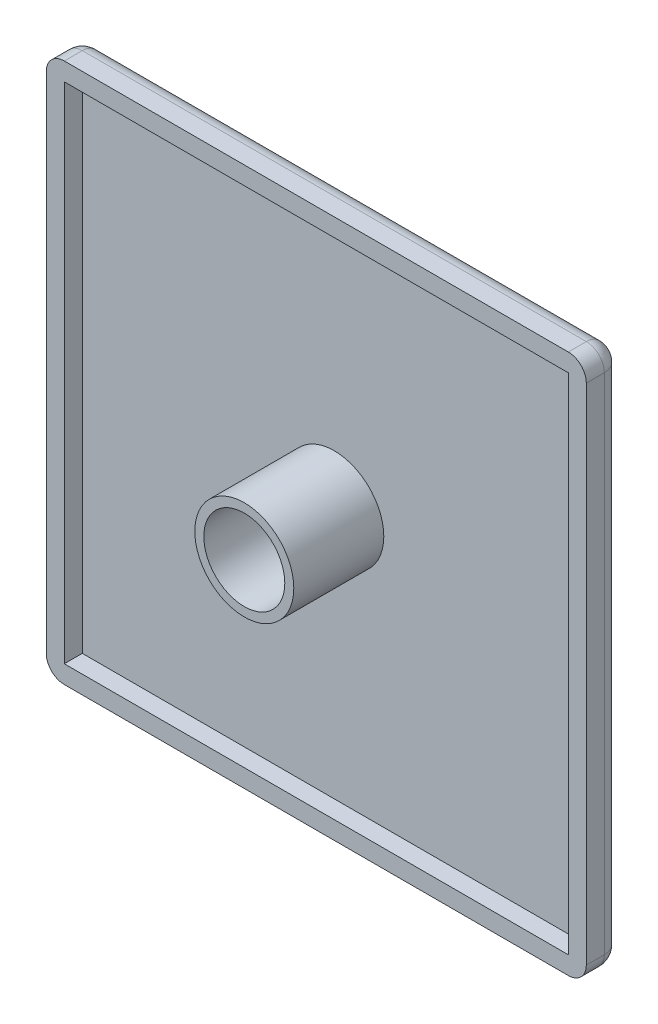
from build123d import *

# Parameters (mm, degrees)
SKETCH_1_W      = 60
SKETCH_1_H      = 60
EXTRUDE_1_DEPTH = 2
SHELL_1_T       = -2
FILLET_2_R      = 2
SKETCH_3_R      = 5.5
SKETCH_3_R_2    = 4.5
EXTRUDE_3_DEPTH = 10


with BuildPart() as part:
    # Sketch 1 → Extrude 1 (new, symmetric)
    with BuildSketch(Plane.XY):
        Rectangle(SKETCH_1_W, SKETCH_1_H)
    extrude(amount=EXTRUDE_1_DEPTH, both=True)

    # Shell 1
    shell_1_openings = [part.faces().sort_by_distance(p)[0] for p in [
        (0, 0, 2),
    ]]
    offset(amount=SHELL_1_T, openings=shell_1_openings, kind=Kind.INTERSECTION)

    # Fillet 2
    fillet_2_edges = [part.edges().sort_by_distance(p)[0] for p in [
        (0, 30, -2),
        (30, 0, -2),
        (0, -30, -2),
        (-30, 0, -2),
        (-30, 30, 0),
        (30, 30, 0),
        (30, -30, 0),
        (-30, -30, 0),
    ]]
    fillet(fillet_2_edges, radius=FILLET_2_R)

    # Sketch 3 → Extrude 3 (add)
    with BuildSketch(Plane.XY):
        Circle(SKETCH_3_R)
        Circle(SKETCH_3_R_2, mode=Mode.SUBTRACT)
    extrude(amount=EXTRUDE_3_DEPTH)


solid = part.part
